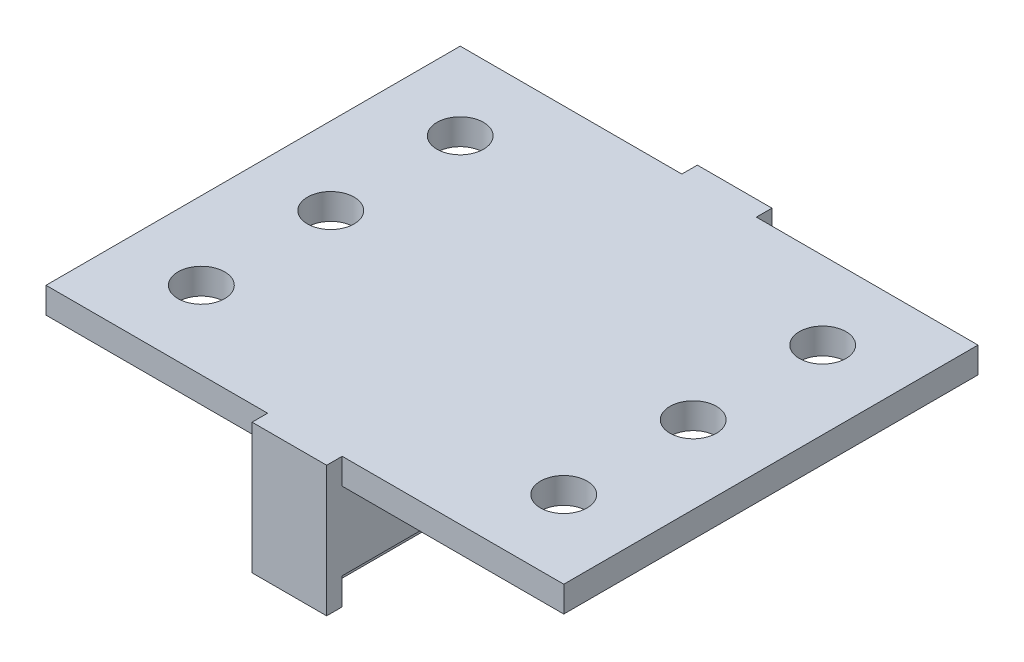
ISO-10303-21;
HEADER;
FILE_DESCRIPTION(('STEP AP214'),'2;1');
FILE_NAME('part.step','',(''),(''),'','','');
FILE_SCHEMA(('AUTOMOTIVE_DESIGN { 1 0 10303 214 1 1 1 1 }'));
ENDSEC;
DATA;
#1=APPLICATION_CONTEXT('core data for automotive mechanical design processes');
#2=APPLICATION_PROTOCOL_DEFINITION('international standard','automotive_design',2000,#1);
#3=PRODUCT_CONTEXT('',#1,'mechanical');
#4=PRODUCT('Part','Part','',(#3));
#5=PRODUCT_RELATED_PRODUCT_CATEGORY('part','',(#4));
#6=PRODUCT_DEFINITION_FORMATION('','',#4);
#7=PRODUCT_DEFINITION_CONTEXT('part definition',#1,'design');
#8=PRODUCT_DEFINITION('design','',#6,#7);
#9=PRODUCT_DEFINITION_SHAPE('','',#8);
#10=(LENGTH_UNIT() NAMED_UNIT(*) SI_UNIT(.MILLI.,.METRE.));
#11=(NAMED_UNIT(*) PLANE_ANGLE_UNIT() SI_UNIT($,.RADIAN.));
#12=(NAMED_UNIT(*) SI_UNIT($,.STERADIAN.) SOLID_ANGLE_UNIT());
#13=UNCERTAINTY_MEASURE_WITH_UNIT(LENGTH_MEASURE(1.E-05),#10,'distance_accuracy_value','');
#14=(GEOMETRIC_REPRESENTATION_CONTEXT(3) GLOBAL_UNCERTAINTY_ASSIGNED_CONTEXT((#13)) GLOBAL_UNIT_ASSIGNED_CONTEXT((#10,
#11,#12)) REPRESENTATION_CONTEXT('',''));
#15=CARTESIAN_POINT('',(0.,0.,0.));
#16=DIRECTION('',(0.,0.,1.));
#17=DIRECTION('',(1.,0.,0.));
#18=AXIS2_PLACEMENT_3D('',#15,#16,#17);
#19=CARTESIAN_POINT('',(0.,0.,0.));
#20=DIRECTION('',(0.,0.,-1.));
#21=DIRECTION('',(-1.,0.,0.));
#22=AXIS2_PLACEMENT_3D('',#19,#20,#21);
#23=PLANE('',#22);
#24=DIRECTION('',(-1.,0.,0.));
#25=VECTOR('',#24,1.);
#26=CARTESIAN_POINT('',(0.,46.0126239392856,0.));
#27=LINE('',#26,#25);
#28=CARTESIAN_POINT('',(42.8,46.0126239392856,0.));
#29=VERTEX_POINT('',#28);
#30=CARTESIAN_POINT('',(0.,46.0126239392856,0.));
#31=VERTEX_POINT('',#30);
#32=EDGE_CURVE('E284',#29,#31,#27,.T.);
#33=ORIENTED_EDGE('',*,*,#32,.F.);
#34=DIRECTION('',(0.,-1.,0.));
#35=VECTOR('',#34,1.);
#36=CARTESIAN_POINT('',(42.8,46.0126239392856,0.));
#37=LINE('',#36,#35);
#38=CARTESIAN_POINT('',(42.8,41.0126239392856,0.));
#39=VERTEX_POINT('',#38);
#40=EDGE_CURVE('E189',#29,#39,#37,.T.);
#41=ORIENTED_EDGE('',*,*,#40,.T.);
#42=DIRECTION('',(1.,0.,0.));
#43=VECTOR('',#42,1.);
#44=CARTESIAN_POINT('',(42.8,41.0126239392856,0.));
#45=LINE('',#44,#43);
#46=CARTESIAN_POINT('',(0.,41.0126239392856,0.));
#47=VERTEX_POINT('',#46);
#48=EDGE_CURVE('E290',#47,#39,#45,.T.);
#49=ORIENTED_EDGE('',*,*,#48,.F.);
#50=DIRECTION('',(0.,-1.,0.));
#51=VECTOR('',#50,1.);
#52=CARTESIAN_POINT('',(0.,41.0126239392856,0.));
#53=LINE('',#52,#51);
#54=EDGE_CURVE('E283',#31,#47,#53,.T.);
#55=ORIENTED_EDGE('',*,*,#54,.F.);
#56=EDGE_LOOP('',(#33,#41,#49,#55));
#57=FACE_BOUND('',#56,.T.);
#58=ADVANCED_FACE('F33',(#57),#23,.T.);
#59=DIRECTION('',(1.,0.,0.));
#60=VECTOR('',#59,1.);
#61=CARTESIAN_POINT('',(57.2,41.0126239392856,0.));
#62=LINE('',#61,#60);
#63=CARTESIAN_POINT('',(57.2,41.0126239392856,0.));
#64=VERTEX_POINT('',#63);
#65=CARTESIAN_POINT('',(100.,41.0126239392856,0.));
#66=VERTEX_POINT('',#65);
#67=EDGE_CURVE('E465',#64,#66,#62,.T.);
#68=ORIENTED_EDGE('',*,*,#67,.F.);
#69=DIRECTION('',(0.,1.,0.));
#70=VECTOR('',#69,1.);
#71=CARTESIAN_POINT('',(57.2,20.8126239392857,0.));
#72=LINE('',#71,#70);
#73=CARTESIAN_POINT('',(57.2,46.0126239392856,0.));
#74=VERTEX_POINT('',#73);
#75=EDGE_CURVE('E11',#64,#74,#72,.T.);
#76=ORIENTED_EDGE('',*,*,#75,.T.);
#77=CARTESIAN_POINT('',(100.,46.0126239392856,0.));
#78=VERTEX_POINT('',#77);
#79=EDGE_CURVE('E177',#78,#74,#27,.T.);
#80=ORIENTED_EDGE('',*,*,#79,.F.);
#81=DIRECTION('',(0.,1.,0.));
#82=VECTOR('',#81,1.);
#83=CARTESIAN_POINT('',(100.,46.0126239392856,0.));
#84=LINE('',#83,#82);
#85=EDGE_CURVE('E287',#66,#78,#84,.T.);
#86=ORIENTED_EDGE('',*,*,#85,.F.);
#87=EDGE_LOOP('',(#68,#76,#80,#86));
#88=FACE_BOUND('',#87,.T.);
#89=ADVANCED_FACE('F476',(#88),#23,.T.);
#90=CARTESIAN_POINT('',(0.,0.,80.));
#91=DIRECTION('',(0.,0.,-1.));
#92=DIRECTION('',(-1.,0.,0.));
#93=AXIS2_PLACEMENT_3D('',#90,#91,#92);
#94=PLANE('',#93);
#95=DIRECTION('',(0.,1.,0.));
#96=VECTOR('',#95,1.);
#97=CARTESIAN_POINT('',(57.2,20.8126239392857,80.));
#98=LINE('',#97,#96);
#99=CARTESIAN_POINT('',(57.2,41.0126239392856,80.));
#100=VERTEX_POINT('',#99);
#101=CARTESIAN_POINT('',(57.2,46.0126239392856,80.));
#102=VERTEX_POINT('',#101);
#103=EDGE_CURVE('E42',#100,#102,#98,.T.);
#104=ORIENTED_EDGE('',*,*,#103,.F.);
#105=DIRECTION('',(1.,0.,0.));
#106=VECTOR('',#105,1.);
#107=CARTESIAN_POINT('',(57.2,41.0126239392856,80.));
#108=LINE('',#107,#106);
#109=CARTESIAN_POINT('',(100.,41.0126239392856,80.));
#110=VERTEX_POINT('',#109);
#111=EDGE_CURVE('E358',#100,#110,#108,.T.);
#112=ORIENTED_EDGE('',*,*,#111,.T.);
#113=DIRECTION('',(0.,1.,0.));
#114=VECTOR('',#113,1.);
#115=CARTESIAN_POINT('',(100.,46.0126239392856,80.));
#116=LINE('',#115,#114);
#117=CARTESIAN_POINT('',(100.,46.0126239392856,80.));
#118=VERTEX_POINT('',#117);
#119=EDGE_CURVE('E359',#110,#118,#116,.T.);
#120=ORIENTED_EDGE('',*,*,#119,.T.);
#121=DIRECTION('',(-1.,0.,0.));
#122=VECTOR('',#121,1.);
#123=CARTESIAN_POINT('',(0.,46.0126239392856,80.));
#124=LINE('',#123,#122);
#125=EDGE_CURVE('E390',#118,#102,#124,.T.);
#126=ORIENTED_EDGE('',*,*,#125,.T.);
#127=EDGE_LOOP('',(#104,#112,#120,#126));
#128=FACE_BOUND('',#127,.T.);
#129=ADVANCED_FACE('F495',(#128),#94,.F.);
#130=DIRECTION('',(0.,-1.,0.));
#131=VECTOR('',#130,1.);
#132=CARTESIAN_POINT('',(42.8,46.0126239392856,80.));
#133=LINE('',#132,#131);
#134=CARTESIAN_POINT('',(42.8,46.0126239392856,80.));
#135=VERTEX_POINT('',#134);
#136=CARTESIAN_POINT('',(42.8,41.0126239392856,80.));
#137=VERTEX_POINT('',#136);
#138=EDGE_CURVE('E57',#135,#137,#133,.T.);
#139=ORIENTED_EDGE('',*,*,#138,.F.);
#140=CARTESIAN_POINT('',(0.,46.0126239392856,80.));
#141=VERTEX_POINT('',#140);
#142=EDGE_CURVE('E250',#135,#141,#124,.T.);
#143=ORIENTED_EDGE('',*,*,#142,.T.);
#144=DIRECTION('',(0.,-1.,0.));
#145=VECTOR('',#144,1.);
#146=CARTESIAN_POINT('',(0.,41.0126239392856,80.));
#147=LINE('',#146,#145);
#148=CARTESIAN_POINT('',(0.,41.0126239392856,80.));
#149=VERTEX_POINT('',#148);
#150=EDGE_CURVE('E264',#141,#149,#147,.T.);
#151=ORIENTED_EDGE('',*,*,#150,.T.);
#152=DIRECTION('',(1.,0.,0.));
#153=VECTOR('',#152,1.);
#154=CARTESIAN_POINT('',(42.8,41.0126239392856,80.));
#155=LINE('',#154,#153);
#156=EDGE_CURVE('E258',#149,#137,#155,.T.);
#157=ORIENTED_EDGE('',*,*,#156,.T.);
#158=EDGE_LOOP('',(#139,#143,#151,#157));
#159=FACE_BOUND('',#158,.T.);
#160=ADVANCED_FACE('F493',(#159),#94,.F.);
#161=CARTESIAN_POINT('',(52.4,20.8126239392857,80.));
#162=DIRECTION('',(-1.,0.,0.));
#163=DIRECTION('',(0.,0.,1.));
#164=AXIS2_PLACEMENT_3D('',#161,#162,#163);
#165=PLANE('',#164);
#166=DIRECTION('',(0.,1.,0.));
#167=VECTOR('',#166,1.);
#168=CARTESIAN_POINT('',(52.4,20.8126239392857,0.));
#169=LINE('',#168,#167);
#170=CARTESIAN_POINT('',(52.4,20.8126239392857,0.));
#171=VERTEX_POINT('',#170);
#172=CARTESIAN_POINT('',(52.4,26.0126239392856,0.));
#173=VERTEX_POINT('',#172);
#174=EDGE_CURVE('E329',#171,#173,#169,.T.);
#175=ORIENTED_EDGE('',*,*,#174,.T.);
#176=DIRECTION('',(0.,0.,-1.));
#177=VECTOR('',#176,1.);
#178=CARTESIAN_POINT('',(52.4,26.0126239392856,80.));
#179=LINE('',#178,#177);
#180=CARTESIAN_POINT('',(52.4,26.0126239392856,80.));
#181=VERTEX_POINT('',#180);
#182=EDGE_CURVE('E249',#181,#173,#179,.T.);
#183=ORIENTED_EDGE('',*,*,#182,.F.);
#184=DIRECTION('',(0.,1.,0.));
#185=VECTOR('',#184,1.);
#186=CARTESIAN_POINT('',(52.4,20.8126239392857,80.));
#187=LINE('',#186,#185);
#188=CARTESIAN_POINT('',(52.4,20.8126239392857,80.));
#189=VERTEX_POINT('',#188);
#190=EDGE_CURVE('E299',#189,#181,#187,.T.);
#191=ORIENTED_EDGE('',*,*,#190,.F.);
#192=DIRECTION('',(0.,0.,-1.));
#193=VECTOR('',#192,1.);
#194=CARTESIAN_POINT('',(52.4,20.8126239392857,80.));
#195=LINE('',#194,#193);
#196=EDGE_CURVE('E273',#189,#171,#195,.T.);
#197=ORIENTED_EDGE('',*,*,#196,.T.);
#198=EDGE_LOOP('',(#175,#183,#191,#197));
#199=FACE_BOUND('',#198,.T.);
#200=ADVANCED_FACE('F35',(#199),#165,.F.);
#201=CARTESIAN_POINT('',(52.4,26.0126239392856,80.));
#202=DIRECTION('',(0.,1.,0.));
#203=DIRECTION('',(0.,0.,1.));
#204=AXIS2_PLACEMENT_3D('',#201,#202,#203);
#205=PLANE('',#204);
#206=DIRECTION('',(1.,0.,0.));
#207=VECTOR('',#206,1.);
#208=CARTESIAN_POINT('',(52.4,26.0126239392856,0.));
#209=LINE('',#208,#207);
#210=CARTESIAN_POINT('',(57.2,26.0126239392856,0.));
#211=VERTEX_POINT('',#210);
#212=EDGE_CURVE('E471',#173,#211,#209,.T.);
#213=ORIENTED_EDGE('',*,*,#212,.T.);
#214=DIRECTION('',(0.,0.,-1.));
#215=VECTOR('',#214,1.);
#216=CARTESIAN_POINT('',(57.2,26.0126239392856,80.));
#217=LINE('',#216,#215);
#218=CARTESIAN_POINT('',(57.2,26.0126239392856,80.));
#219=VERTEX_POINT('',#218);
#220=EDGE_CURVE('E333',#219,#211,#217,.T.);
#221=ORIENTED_EDGE('',*,*,#220,.F.);
#222=DIRECTION('',(1.,0.,0.));
#223=VECTOR('',#222,1.);
#224=CARTESIAN_POINT('',(52.4,26.0126239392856,80.));
#225=LINE('',#224,#223);
#226=EDGE_CURVE('E347',#181,#219,#225,.T.);
#227=ORIENTED_EDGE('',*,*,#226,.F.);
#228=ORIENTED_EDGE('',*,*,#182,.T.);
#229=EDGE_LOOP('',(#213,#221,#227,#228));
#230=FACE_BOUND('',#229,.T.);
#231=ADVANCED_FACE('F501',(#230),#205,.F.);
#232=CARTESIAN_POINT('',(57.2,26.0126239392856,80.));
#233=DIRECTION('',(-1.,0.,0.));
#234=DIRECTION('',(0.,0.,1.));
#235=AXIS2_PLACEMENT_3D('',#232,#233,#234);
#236=PLANE('',#235);
#237=ORIENTED_EDGE('',*,*,#220,.T.);
#238=CARTESIAN_POINT('',(57.2,20.8126239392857,0.));
#239=VERTEX_POINT('',#238);
#240=EDGE_CURVE('E208',#239,#211,#72,.T.);
#241=ORIENTED_EDGE('',*,*,#240,.F.);
#242=DIRECTION('',(0.,0.,1.));
#243=VECTOR('',#242,1.);
#244=CARTESIAN_POINT('',(57.2,20.8126239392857,-3.));
#245=LINE('',#244,#243);
#246=CARTESIAN_POINT('',(57.2,20.8126239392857,-3.));
#247=VERTEX_POINT('',#246);
#248=EDGE_CURVE('E179',#247,#239,#245,.T.);
#249=ORIENTED_EDGE('',*,*,#248,.F.);
#250=DIRECTION('',(0.,1.,0.));
#251=VECTOR('',#250,1.);
#252=CARTESIAN_POINT('',(57.2,20.8126239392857,-3.));
#253=LINE('',#252,#251);
#254=CARTESIAN_POINT('',(57.2,46.0126239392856,-3.));
#255=VERTEX_POINT('',#254);
#256=EDGE_CURVE('E185',#247,#255,#253,.T.);
#257=ORIENTED_EDGE('',*,*,#256,.T.);
#258=DIRECTION('',(0.,0.,1.));
#259=VECTOR('',#258,1.);
#260=CARTESIAN_POINT('',(57.2,46.0126239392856,-3.));
#261=LINE('',#260,#259);
#262=EDGE_CURVE('E50',#255,#74,#261,.T.);
#263=ORIENTED_EDGE('',*,*,#262,.T.);
#264=ORIENTED_EDGE('',*,*,#75,.F.);
#265=DIRECTION('',(0.,0.,-1.));
#266=VECTOR('',#265,1.);
#267=CARTESIAN_POINT('',(57.2,41.0126239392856,80.));
#268=LINE('',#267,#266);
#269=EDGE_CURVE('E338',#100,#64,#268,.T.);
#270=ORIENTED_EDGE('',*,*,#269,.F.);
#271=ORIENTED_EDGE('',*,*,#103,.T.);
#272=DIRECTION('',(0.,0.,-1.));
#273=VECTOR('',#272,1.);
#274=CARTESIAN_POINT('',(57.2,46.0126239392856,83.));
#275=LINE('',#274,#273);
#276=CARTESIAN_POINT('',(57.2,46.0126239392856,83.));
#277=VERTEX_POINT('',#276);
#278=EDGE_CURVE('E223',#277,#102,#275,.T.);
#279=ORIENTED_EDGE('',*,*,#278,.F.);
#280=DIRECTION('',(0.,1.,0.));
#281=VECTOR('',#280,1.);
#282=CARTESIAN_POINT('',(57.2,20.8126239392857,83.));
#283=LINE('',#282,#281);
#284=CARTESIAN_POINT('',(57.2,20.8126239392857,83.));
#285=VERTEX_POINT('',#284);
#286=EDGE_CURVE('E221',#285,#277,#283,.T.);
#287=ORIENTED_EDGE('',*,*,#286,.F.);
#288=DIRECTION('',(0.,0.,-1.));
#289=VECTOR('',#288,1.);
#290=CARTESIAN_POINT('',(57.2,20.8126239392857,83.));
#291=LINE('',#290,#289);
#292=CARTESIAN_POINT('',(57.2,20.8126239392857,80.));
#293=VERTEX_POINT('',#292);
#294=EDGE_CURVE('E243',#285,#293,#291,.T.);
#295=ORIENTED_EDGE('',*,*,#294,.T.);
#296=EDGE_CURVE('E217',#293,#219,#98,.T.);
#297=ORIENTED_EDGE('',*,*,#296,.T.);
#298=EDGE_LOOP('',(#237,#241,#249,#257,#263,#264,#270,#271,#279,#287,#295,#297));
#299=FACE_BOUND('',#298,.T.);
#300=ADVANCED_FACE('F192',(#299),#236,.F.);
#301=CARTESIAN_POINT('',(57.2,41.0126239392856,80.));
#302=DIRECTION('',(0.,1.,0.));
#303=DIRECTION('',(0.,0.,1.));
#304=AXIS2_PLACEMENT_3D('',#301,#302,#303);
#305=PLANE('',#304);
#306=CARTESIAN_POINT('',(85.,41.0126239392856,15.));
#307=DIRECTION('',(0.,1.,0.));
#308=DIRECTION('',(0.,0.,1.));
#309=AXIS2_PLACEMENT_3D('',#306,#307,#308);
#310=CIRCLE('',#309,4.49999999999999);
#311=CARTESIAN_POINT('',(85.,41.0126239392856,19.5));
#312=VERTEX_POINT('',#311);
#313=EDGE_CURVE('E411',#312,#312,#310,.T.);
#314=ORIENTED_EDGE('',*,*,#313,.T.);
#315=EDGE_LOOP('',(#314));
#316=FACE_BOUND('',#315,.T.);
#317=CARTESIAN_POINT('',(85.,41.0126239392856,40.));
#318=DIRECTION('',(0.,1.,0.));
#319=DIRECTION('',(0.,0.,1.));
#320=AXIS2_PLACEMENT_3D('',#317,#318,#319);
#321=CIRCLE('',#320,4.49999999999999);
#322=CARTESIAN_POINT('',(85.,41.0126239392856,44.5));
#323=VERTEX_POINT('',#322);
#324=EDGE_CURVE('E405',#323,#323,#321,.T.);
#325=ORIENTED_EDGE('',*,*,#324,.T.);
#326=EDGE_LOOP('',(#325));
#327=FACE_BOUND('',#326,.T.);
#328=CARTESIAN_POINT('',(85.,41.0126239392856,65.));
#329=DIRECTION('',(0.,1.,0.));
#330=DIRECTION('',(0.,0.,1.));
#331=AXIS2_PLACEMENT_3D('',#328,#329,#330);
#332=CIRCLE('',#331,4.49999999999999);
#333=CARTESIAN_POINT('',(85.,41.0126239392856,69.5));
#334=VERTEX_POINT('',#333);
#335=EDGE_CURVE('E399',#334,#334,#332,.T.);
#336=ORIENTED_EDGE('',*,*,#335,.T.);
#337=EDGE_LOOP('',(#336));
#338=FACE_BOUND('',#337,.T.);
#339=ORIENTED_EDGE('',*,*,#67,.T.);
#340=DIRECTION('',(0.,0.,-1.));
#341=VECTOR('',#340,1.);
#342=CARTESIAN_POINT('',(100.,41.0126239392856,80.));
#343=LINE('',#342,#341);
#344=EDGE_CURVE('E343',#110,#66,#343,.T.);
#345=ORIENTED_EDGE('',*,*,#344,.F.);
#346=ORIENTED_EDGE('',*,*,#111,.F.);
#347=ORIENTED_EDGE('',*,*,#269,.T.);
#348=EDGE_LOOP('',(#339,#345,#346,#347));
#349=FACE_BOUND('',#348,.T.);
#350=ADVANCED_FACE('F459',(#316,#327,#338,#349),#305,.F.);
#351=CARTESIAN_POINT('',(100.,46.0126239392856,80.));
#352=DIRECTION('',(-1.,0.,0.));
#353=DIRECTION('',(0.,0.,1.));
#354=AXIS2_PLACEMENT_3D('',#351,#352,#353);
#355=PLANE('',#354);
#356=ORIENTED_EDGE('',*,*,#85,.T.);
#357=DIRECTION('',(0.,0.,-1.));
#358=VECTOR('',#357,1.);
#359=CARTESIAN_POINT('',(100.,46.0126239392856,80.));
#360=LINE('',#359,#358);
#361=EDGE_CURVE('E475',#118,#78,#360,.T.);
#362=ORIENTED_EDGE('',*,*,#361,.F.);
#363=ORIENTED_EDGE('',*,*,#119,.F.);
#364=ORIENTED_EDGE('',*,*,#344,.T.);
#365=EDGE_LOOP('',(#356,#362,#363,#364));
#366=FACE_BOUND('',#365,.T.);
#367=ADVANCED_FACE('F440',(#366),#355,.F.);
#368=CARTESIAN_POINT('',(0.,46.0126239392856,80.));
#369=DIRECTION('',(0.,-1.,0.));
#370=DIRECTION('',(0.,0.,-1.));
#371=AXIS2_PLACEMENT_3D('',#368,#369,#370);
#372=PLANE('',#371);
#373=CARTESIAN_POINT('',(15.,46.0126239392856,65.));
#374=DIRECTION('',(0.,1.,0.));
#375=DIRECTION('',(0.,0.,1.));
#376=AXIS2_PLACEMENT_3D('',#373,#374,#375);
#377=CIRCLE('',#376,4.5);
#378=CARTESIAN_POINT('',(15.,46.0126239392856,69.5));
#379=VERTEX_POINT('',#378);
#380=EDGE_CURVE('E378',#379,#379,#377,.T.);
#381=ORIENTED_EDGE('',*,*,#380,.F.);
#382=EDGE_LOOP('',(#381));
#383=FACE_BOUND('',#382,.T.);
#384=CARTESIAN_POINT('',(15.,46.0126239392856,40.));
#385=DIRECTION('',(0.,1.,0.));
#386=DIRECTION('',(0.,0.,1.));
#387=AXIS2_PLACEMENT_3D('',#384,#385,#386);
#388=CIRCLE('',#387,4.5);
#389=CARTESIAN_POINT('',(15.,46.0126239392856,44.5));
#390=VERTEX_POINT('',#389);
#391=EDGE_CURVE('E426',#390,#390,#388,.T.);
#392=ORIENTED_EDGE('',*,*,#391,.F.);
#393=EDGE_LOOP('',(#392));
#394=FACE_BOUND('',#393,.T.);
#395=CARTESIAN_POINT('',(15.,46.0126239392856,15.));
#396=DIRECTION('',(0.,1.,0.));
#397=DIRECTION('',(0.,0.,1.));
#398=AXIS2_PLACEMENT_3D('',#395,#396,#397);
#399=CIRCLE('',#398,4.5);
#400=CARTESIAN_POINT('',(15.,46.0126239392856,19.5));
#401=VERTEX_POINT('',#400);
#402=EDGE_CURVE('E420',#401,#401,#399,.T.);
#403=ORIENTED_EDGE('',*,*,#402,.F.);
#404=EDGE_LOOP('',(#403));
#405=FACE_BOUND('',#404,.T.);
#406=CARTESIAN_POINT('',(85.,46.0126239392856,15.));
#407=DIRECTION('',(0.,1.,0.));
#408=DIRECTION('',(0.,0.,1.));
#409=AXIS2_PLACEMENT_3D('',#406,#407,#408);
#410=CIRCLE('',#409,4.49999999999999);
#411=CARTESIAN_POINT('',(85.,46.0126239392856,19.5));
#412=VERTEX_POINT('',#411);
#413=EDGE_CURVE('E414',#412,#412,#410,.T.);
#414=ORIENTED_EDGE('',*,*,#413,.F.);
#415=EDGE_LOOP('',(#414));
#416=FACE_BOUND('',#415,.T.);
#417=CARTESIAN_POINT('',(85.,46.0126239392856,40.));
#418=DIRECTION('',(0.,1.,0.));
#419=DIRECTION('',(0.,0.,1.));
#420=AXIS2_PLACEMENT_3D('',#417,#418,#419);
#421=CIRCLE('',#420,4.49999999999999);
#422=CARTESIAN_POINT('',(85.,46.0126239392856,44.5));
#423=VERTEX_POINT('',#422);
#424=EDGE_CURVE('E408',#423,#423,#421,.T.);
#425=ORIENTED_EDGE('',*,*,#424,.F.);
#426=EDGE_LOOP('',(#425));
#427=FACE_BOUND('',#426,.T.);
#428=CARTESIAN_POINT('',(85.,46.0126239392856,65.));
#429=DIRECTION('',(0.,1.,0.));
#430=DIRECTION('',(0.,0.,1.));
#431=AXIS2_PLACEMENT_3D('',#428,#429,#430);
#432=CIRCLE('',#431,4.49999999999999);
#433=CARTESIAN_POINT('',(85.,46.0126239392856,69.5));
#434=VERTEX_POINT('',#433);
#435=EDGE_CURVE('E402',#434,#434,#432,.T.);
#436=ORIENTED_EDGE('',*,*,#435,.F.);
#437=EDGE_LOOP('',(#436));
#438=FACE_BOUND('',#437,.T.);
#439=ORIENTED_EDGE('',*,*,#79,.T.);
#440=ORIENTED_EDGE('',*,*,#262,.F.);
#441=DIRECTION('',(-1.,0.,0.));
#442=VECTOR('',#441,1.);
#443=CARTESIAN_POINT('',(42.8,46.0126239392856,-3.));
#444=LINE('',#443,#442);
#445=CARTESIAN_POINT('',(42.8,46.0126239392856,-3.));
#446=VERTEX_POINT('',#445);
#447=EDGE_CURVE('E173',#255,#446,#444,.T.);
#448=ORIENTED_EDGE('',*,*,#447,.T.);
#449=DIRECTION('',(0.,0.,1.));
#450=VECTOR('',#449,1.);
#451=CARTESIAN_POINT('',(42.8,46.0126239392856,-3.));
#452=LINE('',#451,#450);
#453=EDGE_CURVE('E200',#446,#29,#452,.T.);
#454=ORIENTED_EDGE('',*,*,#453,.T.);
#455=ORIENTED_EDGE('',*,*,#32,.T.);
#456=DIRECTION('',(0.,0.,-1.));
#457=VECTOR('',#456,1.);
#458=CARTESIAN_POINT('',(0.,46.0126239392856,80.));
#459=LINE('',#458,#457);
#460=EDGE_CURVE('E480',#141,#31,#459,.T.);
#461=ORIENTED_EDGE('',*,*,#460,.F.);
#462=ORIENTED_EDGE('',*,*,#142,.F.);
#463=DIRECTION('',(0.,0.,-1.));
#464=VECTOR('',#463,1.);
#465=CARTESIAN_POINT('',(42.8,46.0126239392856,83.));
#466=LINE('',#465,#464);
#467=CARTESIAN_POINT('',(42.8,46.0126239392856,83.));
#468=VERTEX_POINT('',#467);
#469=EDGE_CURVE('E375',#468,#135,#466,.T.);
#470=ORIENTED_EDGE('',*,*,#469,.F.);
#471=DIRECTION('',(-1.,0.,0.));
#472=VECTOR('',#471,1.);
#473=CARTESIAN_POINT('',(42.8,46.0126239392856,83.));
#474=LINE('',#473,#472);
#475=EDGE_CURVE('E213',#277,#468,#474,.T.);
#476=ORIENTED_EDGE('',*,*,#475,.F.);
#477=ORIENTED_EDGE('',*,*,#278,.T.);
#478=ORIENTED_EDGE('',*,*,#125,.F.);
#479=ORIENTED_EDGE('',*,*,#361,.T.);
#480=EDGE_LOOP('',(#439,#440,#448,#454,#455,#461,#462,#470,#476,#477,#478,#479));
#481=FACE_BOUND('',#480,.T.);
#482=ADVANCED_FACE('F172',(#383,#394,#405,#416,#427,#438,#481),#372,.F.);
#483=CARTESIAN_POINT('',(0.,41.0126239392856,80.));
#484=DIRECTION('',(1.,0.,0.));
#485=DIRECTION('',(0.,0.,-1.));
#486=AXIS2_PLACEMENT_3D('',#483,#484,#485);
#487=PLANE('',#486);
#488=ORIENTED_EDGE('',*,*,#54,.T.);
#489=DIRECTION('',(0.,0.,-1.));
#490=VECTOR('',#489,1.);
#491=CARTESIAN_POINT('',(0.,41.0126239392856,80.));
#492=LINE('',#491,#490);
#493=EDGE_CURVE('E384',#149,#47,#492,.T.);
#494=ORIENTED_EDGE('',*,*,#493,.F.);
#495=ORIENTED_EDGE('',*,*,#150,.F.);
#496=ORIENTED_EDGE('',*,*,#460,.T.);
#497=EDGE_LOOP('',(#488,#494,#495,#496));
#498=FACE_BOUND('',#497,.T.);
#499=ADVANCED_FACE('F439',(#498),#487,.F.);
#500=CARTESIAN_POINT('',(42.8,41.0126239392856,80.));
#501=DIRECTION('',(0.,1.,0.));
#502=DIRECTION('',(0.,0.,1.));
#503=AXIS2_PLACEMENT_3D('',#500,#501,#502);
#504=PLANE('',#503);
#505=CARTESIAN_POINT('',(15.,41.0126239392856,65.));
#506=DIRECTION('',(0.,1.,0.));
#507=DIRECTION('',(0.,0.,1.));
#508=AXIS2_PLACEMENT_3D('',#505,#506,#507);
#509=CIRCLE('',#508,4.5);
#510=CARTESIAN_POINT('',(15.,41.0126239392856,69.5));
#511=VERTEX_POINT('',#510);
#512=EDGE_CURVE('E429',#511,#511,#509,.T.);
#513=ORIENTED_EDGE('',*,*,#512,.T.);
#514=EDGE_LOOP('',(#513));
#515=FACE_BOUND('',#514,.T.);
#516=CARTESIAN_POINT('',(15.,41.0126239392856,40.));
#517=DIRECTION('',(0.,1.,0.));
#518=DIRECTION('',(0.,0.,1.));
#519=AXIS2_PLACEMENT_3D('',#516,#517,#518);
#520=CIRCLE('',#519,4.5);
#521=CARTESIAN_POINT('',(15.,41.0126239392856,44.5));
#522=VERTEX_POINT('',#521);
#523=EDGE_CURVE('E423',#522,#522,#520,.T.);
#524=ORIENTED_EDGE('',*,*,#523,.T.);
#525=EDGE_LOOP('',(#524));
#526=FACE_BOUND('',#525,.T.);
#527=CARTESIAN_POINT('',(15.,41.0126239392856,15.));
#528=DIRECTION('',(0.,1.,0.));
#529=DIRECTION('',(0.,0.,1.));
#530=AXIS2_PLACEMENT_3D('',#527,#528,#529);
#531=CIRCLE('',#530,4.5);
#532=CARTESIAN_POINT('',(15.,41.0126239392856,19.5));
#533=VERTEX_POINT('',#532);
#534=EDGE_CURVE('E417',#533,#533,#531,.T.);
#535=ORIENTED_EDGE('',*,*,#534,.T.);
#536=EDGE_LOOP('',(#535));
#537=FACE_BOUND('',#536,.T.);
#538=ORIENTED_EDGE('',*,*,#48,.T.);
#539=DIRECTION('',(0.,0.,-1.));
#540=VECTOR('',#539,1.);
#541=CARTESIAN_POINT('',(42.8,41.0126239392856,80.));
#542=LINE('',#541,#540);
#543=EDGE_CURVE('E381',#137,#39,#542,.T.);
#544=ORIENTED_EDGE('',*,*,#543,.F.);
#545=ORIENTED_EDGE('',*,*,#156,.F.);
#546=ORIENTED_EDGE('',*,*,#493,.T.);
#547=EDGE_LOOP('',(#538,#544,#545,#546));
#548=FACE_BOUND('',#547,.T.);
#549=ADVANCED_FACE('F488',(#515,#526,#537,#548),#504,.F.);
#550=CARTESIAN_POINT('',(42.8,26.0126239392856,80.));
#551=DIRECTION('',(1.,0.,0.));
#552=DIRECTION('',(0.,0.,-1.));
#553=AXIS2_PLACEMENT_3D('',#550,#551,#552);
#554=PLANE('',#553);
#555=ORIENTED_EDGE('',*,*,#543,.T.);
#556=ORIENTED_EDGE('',*,*,#40,.F.);
#557=ORIENTED_EDGE('',*,*,#453,.F.);
#558=DIRECTION('',(0.,-1.,0.));
#559=VECTOR('',#558,1.);
#560=CARTESIAN_POINT('',(42.8,46.0126239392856,-3.));
#561=LINE('',#560,#559);
#562=CARTESIAN_POINT('',(42.8,20.8126239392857,-3.));
#563=VERTEX_POINT('',#562);
#564=EDGE_CURVE('E188',#446,#563,#561,.T.);
#565=ORIENTED_EDGE('',*,*,#564,.T.);
#566=DIRECTION('',(0.,0.,1.));
#567=VECTOR('',#566,1.);
#568=CARTESIAN_POINT('',(42.8,20.8126239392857,-3.));
#569=LINE('',#568,#567);
#570=CARTESIAN_POINT('',(42.8,20.8126239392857,0.));
#571=VERTEX_POINT('',#570);
#572=EDGE_CURVE('E310',#563,#571,#569,.T.);
#573=ORIENTED_EDGE('',*,*,#572,.T.);
#574=CARTESIAN_POINT('',(42.8,26.0126239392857,0.));
#575=VERTEX_POINT('',#574);
#576=EDGE_CURVE('E321',#575,#571,#37,.T.);
#577=ORIENTED_EDGE('',*,*,#576,.F.);
#578=DIRECTION('',(0.,0.,-1.));
#579=VECTOR('',#578,1.);
#580=CARTESIAN_POINT('',(42.8,26.0126239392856,80.));
#581=LINE('',#580,#579);
#582=CARTESIAN_POINT('',(42.8,26.0126239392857,80.));
#583=VERTEX_POINT('',#582);
#584=EDGE_CURVE('E259',#583,#575,#581,.T.);
#585=ORIENTED_EDGE('',*,*,#584,.F.);
#586=CARTESIAN_POINT('',(42.8,20.8126239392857,80.));
#587=VERTEX_POINT('',#586);
#588=EDGE_CURVE('E178',#583,#587,#133,.T.);
#589=ORIENTED_EDGE('',*,*,#588,.T.);
#590=DIRECTION('',(0.,0.,-1.));
#591=VECTOR('',#590,1.);
#592=CARTESIAN_POINT('',(42.8,20.8126239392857,83.));
#593=LINE('',#592,#591);
#594=CARTESIAN_POINT('',(42.8,20.8126239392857,83.));
#595=VERTEX_POINT('',#594);
#596=EDGE_CURVE('E240',#595,#587,#593,.T.);
#597=ORIENTED_EDGE('',*,*,#596,.F.);
#598=DIRECTION('',(0.,-1.,0.));
#599=VECTOR('',#598,1.);
#600=CARTESIAN_POINT('',(42.8,46.0126239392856,83.));
#601=LINE('',#600,#599);
#602=EDGE_CURVE('E216',#468,#595,#601,.T.);
#603=ORIENTED_EDGE('',*,*,#602,.F.);
#604=ORIENTED_EDGE('',*,*,#469,.T.);
#605=ORIENTED_EDGE('',*,*,#138,.T.);
#606=EDGE_LOOP('',(#555,#556,#557,#565,#573,#577,#585,#589,#597,#603,#604,#605));
#607=FACE_BOUND('',#606,.T.);
#608=ADVANCED_FACE('F489',(#607),#554,.F.);
#609=CARTESIAN_POINT('',(47.6,26.0126239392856,80.));
#610=DIRECTION('',(0.,1.,0.));
#611=DIRECTION('',(0.,0.,1.));
#612=AXIS2_PLACEMENT_3D('',#609,#610,#611);
#613=PLANE('',#612);
#614=DIRECTION('',(1.,0.,0.));
#615=VECTOR('',#614,1.);
#616=CARTESIAN_POINT('',(47.6,26.0126239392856,0.));
#617=LINE('',#616,#615);
#618=CARTESIAN_POINT('',(47.6,26.0126239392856,0.));
#619=VERTEX_POINT('',#618);
#620=EDGE_CURVE('E300',#575,#619,#617,.T.);
#621=ORIENTED_EDGE('',*,*,#620,.T.);
#622=DIRECTION('',(0.,0.,-1.));
#623=VECTOR('',#622,1.);
#624=CARTESIAN_POINT('',(47.6,26.0126239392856,80.));
#625=LINE('',#624,#623);
#626=CARTESIAN_POINT('',(47.6,26.0126239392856,80.));
#627=VERTEX_POINT('',#626);
#628=EDGE_CURVE('E279',#627,#619,#625,.T.);
#629=ORIENTED_EDGE('',*,*,#628,.F.);
#630=DIRECTION('',(1.,0.,0.));
#631=VECTOR('',#630,1.);
#632=CARTESIAN_POINT('',(47.6,26.0126239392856,80.));
#633=LINE('',#632,#631);
#634=EDGE_CURVE('E253',#583,#627,#633,.T.);
#635=ORIENTED_EDGE('',*,*,#634,.F.);
#636=ORIENTED_EDGE('',*,*,#584,.T.);
#637=EDGE_LOOP('',(#621,#629,#635,#636));
#638=FACE_BOUND('',#637,.T.);
#639=ADVANCED_FACE('F514',(#638),#613,.F.);
#640=CARTESIAN_POINT('',(47.6,20.8126239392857,80.));
#641=DIRECTION('',(1.,0.,0.));
#642=DIRECTION('',(0.,0.,-1.));
#643=AXIS2_PLACEMENT_3D('',#640,#641,#642);
#644=PLANE('',#643);
#645=DIRECTION('',(0.,-1.,0.));
#646=VECTOR('',#645,1.);
#647=CARTESIAN_POINT('',(47.6,20.8126239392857,0.));
#648=LINE('',#647,#646);
#649=CARTESIAN_POINT('',(47.6,20.8126239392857,0.));
#650=VERTEX_POINT('',#649);
#651=EDGE_CURVE('E295',#619,#650,#648,.T.);
#652=ORIENTED_EDGE('',*,*,#651,.T.);
#653=DIRECTION('',(0.,0.,-1.));
#654=VECTOR('',#653,1.);
#655=CARTESIAN_POINT('',(47.6,20.8126239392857,80.));
#656=LINE('',#655,#654);
#657=CARTESIAN_POINT('',(47.6,20.8126239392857,80.));
#658=VERTEX_POINT('',#657);
#659=EDGE_CURVE('E276',#658,#650,#656,.T.);
#660=ORIENTED_EDGE('',*,*,#659,.F.);
#661=DIRECTION('',(0.,-1.,0.));
#662=VECTOR('',#661,1.);
#663=CARTESIAN_POINT('',(47.6,20.8126239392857,80.));
#664=LINE('',#663,#662);
#665=EDGE_CURVE('E257',#627,#658,#664,.T.);
#666=ORIENTED_EDGE('',*,*,#665,.F.);
#667=ORIENTED_EDGE('',*,*,#628,.T.);
#668=EDGE_LOOP('',(#652,#660,#666,#667));
#669=FACE_BOUND('',#668,.T.);
#670=ADVANCED_FACE('F511',(#669),#644,.F.);
#671=CARTESIAN_POINT('',(52.4,20.8126239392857,80.));
#672=DIRECTION('',(0.,1.,0.));
#673=DIRECTION('',(0.,0.,1.));
#674=AXIS2_PLACEMENT_3D('',#671,#672,#673);
#675=PLANE('',#674);
#676=ORIENTED_EDGE('',*,*,#659,.T.);
#677=DIRECTION('',(1.,0.,0.));
#678=VECTOR('',#677,1.);
#679=CARTESIAN_POINT('',(42.8,20.8126239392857,0.));
#680=LINE('',#679,#678);
#681=EDGE_CURVE('E322',#571,#650,#680,.T.);
#682=ORIENTED_EDGE('',*,*,#681,.F.);
#683=ORIENTED_EDGE('',*,*,#572,.F.);
#684=DIRECTION('',(1.,0.,0.));
#685=VECTOR('',#684,1.);
#686=CARTESIAN_POINT('',(42.8,20.8126239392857,-3.));
#687=LINE('',#686,#685);
#688=EDGE_CURVE('E195',#563,#247,#687,.T.);
#689=ORIENTED_EDGE('',*,*,#688,.T.);
#690=ORIENTED_EDGE('',*,*,#248,.T.);
#691=EDGE_CURVE('E211',#171,#239,#680,.T.);
#692=ORIENTED_EDGE('',*,*,#691,.F.);
#693=ORIENTED_EDGE('',*,*,#196,.F.);
#694=DIRECTION('',(1.,0.,0.));
#695=VECTOR('',#694,1.);
#696=CARTESIAN_POINT('',(42.8,20.8126239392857,80.));
#697=LINE('',#696,#695);
#698=EDGE_CURVE('E233',#189,#293,#697,.T.);
#699=ORIENTED_EDGE('',*,*,#698,.T.);
#700=ORIENTED_EDGE('',*,*,#294,.F.);
#701=DIRECTION('',(1.,0.,0.));
#702=VECTOR('',#701,1.);
#703=CARTESIAN_POINT('',(42.8,20.8126239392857,83.));
#704=LINE('',#703,#702);
#705=EDGE_CURVE('E219',#595,#285,#704,.T.);
#706=ORIENTED_EDGE('',*,*,#705,.F.);
#707=ORIENTED_EDGE('',*,*,#596,.T.);
#708=EDGE_CURVE('E235',#587,#658,#697,.T.);
#709=ORIENTED_EDGE('',*,*,#708,.T.);
#710=EDGE_LOOP('',(#676,#682,#683,#689,#690,#692,#693,#699,#700,#706,#707,#709));
#711=FACE_BOUND('',#710,.T.);
#712=ADVANCED_FACE('F332',(#711),#675,.F.);
#713=CARTESIAN_POINT('',(85.,46.0126239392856,65.));
#714=DIRECTION('',(0.,1.,0.));
#715=DIRECTION('',(0.,0.,1.));
#716=AXIS2_PLACEMENT_3D('',#713,#714,#715);
#717=CYLINDRICAL_SURFACE('',#716,4.49999999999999);
#718=ORIENTED_EDGE('',*,*,#435,.T.);
#719=EDGE_LOOP('',(#718));
#720=FACE_BOUND('',#719,.T.);
#721=ORIENTED_EDGE('',*,*,#335,.F.);
#722=EDGE_LOOP('',(#721));
#723=FACE_BOUND('',#722,.T.);
#724=ADVANCED_FACE('F452',(#720,#723),#717,.F.);
#725=CARTESIAN_POINT('',(85.,46.0126239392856,40.));
#726=DIRECTION('',(0.,1.,0.));
#727=DIRECTION('',(0.,0.,1.));
#728=AXIS2_PLACEMENT_3D('',#725,#726,#727);
#729=CYLINDRICAL_SURFACE('',#728,4.49999999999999);
#730=ORIENTED_EDGE('',*,*,#424,.T.);
#731=EDGE_LOOP('',(#730));
#732=FACE_BOUND('',#731,.T.);
#733=ORIENTED_EDGE('',*,*,#324,.F.);
#734=EDGE_LOOP('',(#733));
#735=FACE_BOUND('',#734,.T.);
#736=ADVANCED_FACE('F455',(#732,#735),#729,.F.);
#737=CARTESIAN_POINT('',(85.,46.0126239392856,15.));
#738=DIRECTION('',(0.,1.,0.));
#739=DIRECTION('',(0.,0.,1.));
#740=AXIS2_PLACEMENT_3D('',#737,#738,#739);
#741=CYLINDRICAL_SURFACE('',#740,4.49999999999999);
#742=ORIENTED_EDGE('',*,*,#413,.T.);
#743=EDGE_LOOP('',(#742));
#744=FACE_BOUND('',#743,.T.);
#745=ORIENTED_EDGE('',*,*,#313,.F.);
#746=EDGE_LOOP('',(#745));
#747=FACE_BOUND('',#746,.T.);
#748=ADVANCED_FACE('F563',(#744,#747),#741,.F.);
#749=CARTESIAN_POINT('',(15.,46.0126239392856,15.));
#750=DIRECTION('',(0.,1.,0.));
#751=DIRECTION('',(0.,0.,1.));
#752=AXIS2_PLACEMENT_3D('',#749,#750,#751);
#753=CYLINDRICAL_SURFACE('',#752,4.5);
#754=ORIENTED_EDGE('',*,*,#402,.T.);
#755=EDGE_LOOP('',(#754));
#756=FACE_BOUND('',#755,.T.);
#757=ORIENTED_EDGE('',*,*,#534,.F.);
#758=EDGE_LOOP('',(#757));
#759=FACE_BOUND('',#758,.T.);
#760=ADVANCED_FACE('F559',(#756,#759),#753,.F.);
#761=CARTESIAN_POINT('',(15.,46.0126239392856,40.));
#762=DIRECTION('',(0.,1.,0.));
#763=DIRECTION('',(0.,0.,1.));
#764=AXIS2_PLACEMENT_3D('',#761,#762,#763);
#765=CYLINDRICAL_SURFACE('',#764,4.5);
#766=ORIENTED_EDGE('',*,*,#391,.T.);
#767=EDGE_LOOP('',(#766));
#768=FACE_BOUND('',#767,.T.);
#769=ORIENTED_EDGE('',*,*,#523,.F.);
#770=EDGE_LOOP('',(#769));
#771=FACE_BOUND('',#770,.T.);
#772=ADVANCED_FACE('F552',(#768,#771),#765,.F.);
#773=CARTESIAN_POINT('',(15.,46.0126239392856,65.));
#774=DIRECTION('',(0.,1.,0.));
#775=DIRECTION('',(0.,0.,1.));
#776=AXIS2_PLACEMENT_3D('',#773,#774,#775);
#777=CYLINDRICAL_SURFACE('',#776,4.5);
#778=ORIENTED_EDGE('',*,*,#380,.T.);
#779=EDGE_LOOP('',(#778));
#780=FACE_BOUND('',#779,.T.);
#781=ORIENTED_EDGE('',*,*,#512,.F.);
#782=EDGE_LOOP('',(#781));
#783=FACE_BOUND('',#782,.T.);
#784=ADVANCED_FACE('F434',(#780,#783),#777,.F.);
#785=CARTESIAN_POINT('',(0.,0.,80.));
#786=DIRECTION('',(0.,0.,1.));
#787=DIRECTION('',(1.,0.,0.));
#788=AXIS2_PLACEMENT_3D('',#785,#786,#787);
#789=PLANE('',#788);
#790=ORIENTED_EDGE('',*,*,#698,.F.);
#791=ORIENTED_EDGE('',*,*,#190,.T.);
#792=ORIENTED_EDGE('',*,*,#226,.T.);
#793=ORIENTED_EDGE('',*,*,#296,.F.);
#794=EDGE_LOOP('',(#790,#791,#792,#793));
#795=FACE_BOUND('',#794,.T.);
#796=ADVANCED_FACE('F542',(#795),#789,.F.);
#797=ORIENTED_EDGE('',*,*,#588,.F.);
#798=ORIENTED_EDGE('',*,*,#634,.T.);
#799=ORIENTED_EDGE('',*,*,#665,.T.);
#800=ORIENTED_EDGE('',*,*,#708,.F.);
#801=EDGE_LOOP('',(#797,#798,#799,#800));
#802=FACE_BOUND('',#801,.T.);
#803=ADVANCED_FACE('F544',(#802),#789,.F.);
#804=CARTESIAN_POINT('',(0.,0.,83.));
#805=DIRECTION('',(0.,0.,1.));
#806=DIRECTION('',(1.,0.,0.));
#807=AXIS2_PLACEMENT_3D('',#804,#805,#806);
#808=PLANE('',#807);
#809=ORIENTED_EDGE('',*,*,#475,.T.);
#810=ORIENTED_EDGE('',*,*,#602,.T.);
#811=ORIENTED_EDGE('',*,*,#705,.T.);
#812=ORIENTED_EDGE('',*,*,#286,.T.);
#813=EDGE_LOOP('',(#809,#810,#811,#812));
#814=FACE_BOUND('',#813,.T.);
#815=ADVANCED_FACE('F550',(#814),#808,.T.);
#816=CARTESIAN_POINT('',(0.,0.,0.));
#817=DIRECTION('',(0.,0.,-1.));
#818=DIRECTION('',(1.,0.,0.));
#819=AXIS2_PLACEMENT_3D('',#816,#817,#818);
#820=PLANE('',#819);
#821=ORIENTED_EDGE('',*,*,#651,.F.);
#822=ORIENTED_EDGE('',*,*,#620,.F.);
#823=ORIENTED_EDGE('',*,*,#576,.T.);
#824=ORIENTED_EDGE('',*,*,#681,.T.);
#825=EDGE_LOOP('',(#821,#822,#823,#824));
#826=FACE_BOUND('',#825,.T.);
#827=ADVANCED_FACE('F623',(#826),#820,.F.);
#828=CARTESIAN_POINT('',(0.,0.,-3.));
#829=DIRECTION('',(0.,0.,-1.));
#830=DIRECTION('',(1.,0.,0.));
#831=AXIS2_PLACEMENT_3D('',#828,#829,#830);
#832=PLANE('',#831);
#833=ORIENTED_EDGE('',*,*,#447,.F.);
#834=ORIENTED_EDGE('',*,*,#256,.F.);
#835=ORIENTED_EDGE('',*,*,#688,.F.);
#836=ORIENTED_EDGE('',*,*,#564,.F.);
#837=EDGE_LOOP('',(#833,#834,#835,#836));
#838=FACE_BOUND('',#837,.T.);
#839=ADVANCED_FACE('F183',(#838),#832,.T.);
#840=ORIENTED_EDGE('',*,*,#174,.F.);
#841=ORIENTED_EDGE('',*,*,#691,.T.);
#842=ORIENTED_EDGE('',*,*,#240,.T.);
#843=ORIENTED_EDGE('',*,*,#212,.F.);
#844=EDGE_LOOP('',(#840,#841,#842,#843));
#845=FACE_BOUND('',#844,.T.);
#846=ADVANCED_FACE('F326',(#845),#820,.F.);
#847=CLOSED_SHELL('',(#58,#89,#129,#160,#200,#231,#300,#350,#367,#482,#499,#549,#608,#639,#670,
#712,#724,#736,#748,#760,#772,#784,#796,#803,#815,#827,#839,#846));
#848=MANIFOLD_SOLID_BREP('B2',#847);
#849=ADVANCED_BREP_SHAPE_REPRESENTATION('',(#18,#848),#14);
#850=SHAPE_DEFINITION_REPRESENTATION(#9,#849);
ENDSEC;
END-ISO-10303-21;
